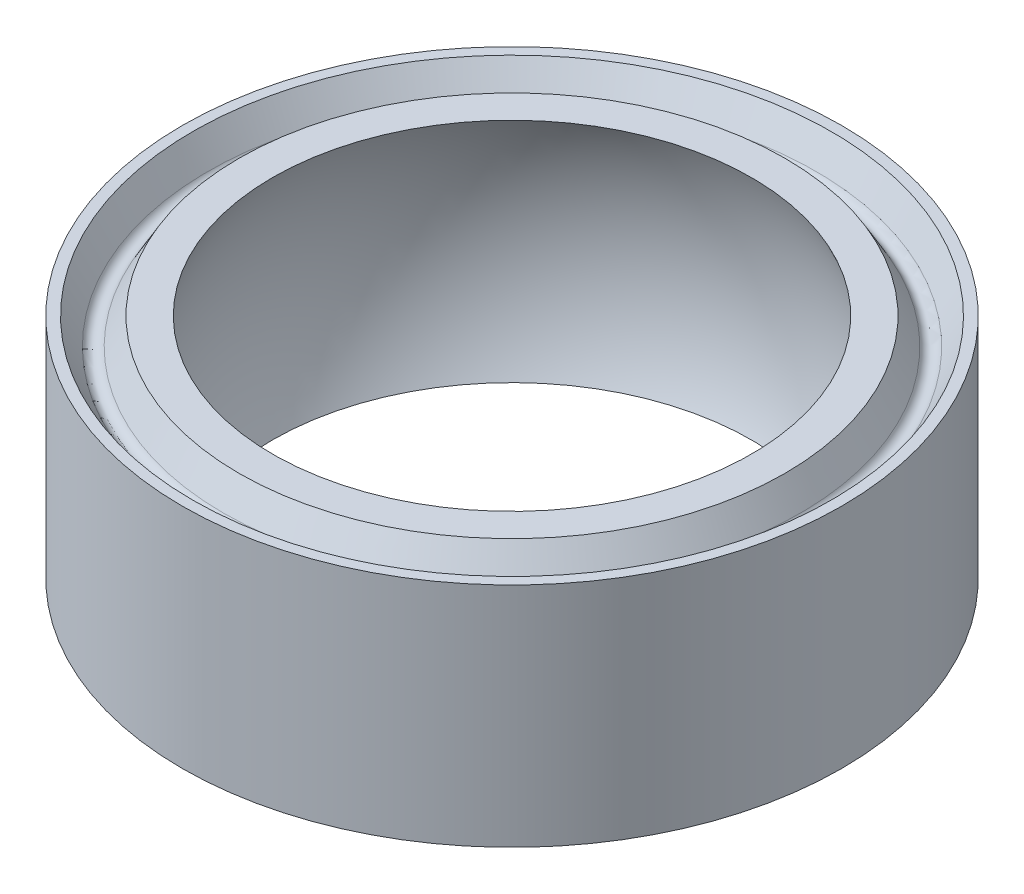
ISO-10303-21;
HEADER;
FILE_DESCRIPTION(('STEP AP214'),'2;1');
FILE_NAME('part.step','',(''),(''),'','','');
FILE_SCHEMA(('AUTOMOTIVE_DESIGN { 1 0 10303 214 1 1 1 1 }'));
ENDSEC;
DATA;
#1=APPLICATION_CONTEXT('core data for automotive mechanical design processes');
#2=APPLICATION_PROTOCOL_DEFINITION('international standard','automotive_design',2000,#1);
#3=PRODUCT_CONTEXT('',#1,'mechanical');
#4=PRODUCT('Part','Part','',(#3));
#5=PRODUCT_RELATED_PRODUCT_CATEGORY('part','',(#4));
#6=PRODUCT_DEFINITION_FORMATION('','',#4);
#7=PRODUCT_DEFINITION_CONTEXT('part definition',#1,'design');
#8=PRODUCT_DEFINITION('design','',#6,#7);
#9=PRODUCT_DEFINITION_SHAPE('','',#8);
#10=(LENGTH_UNIT() NAMED_UNIT(*) SI_UNIT(.MILLI.,.METRE.));
#11=(NAMED_UNIT(*) PLANE_ANGLE_UNIT() SI_UNIT($,.RADIAN.));
#12=(NAMED_UNIT(*) SI_UNIT($,.STERADIAN.) SOLID_ANGLE_UNIT());
#13=UNCERTAINTY_MEASURE_WITH_UNIT(LENGTH_MEASURE(1.E-05),#10,'distance_accuracy_value','');
#14=(GEOMETRIC_REPRESENTATION_CONTEXT(3) GLOBAL_UNCERTAINTY_ASSIGNED_CONTEXT((#13)) GLOBAL_UNIT_ASSIGNED_CONTEXT((#10,
#11,#12)) REPRESENTATION_CONTEXT('',''));
#15=CARTESIAN_POINT('',(0.,0.,0.));
#16=DIRECTION('',(0.,0.,1.));
#17=DIRECTION('',(1.,0.,0.));
#18=AXIS2_PLACEMENT_3D('',#15,#16,#17);
#19=CARTESIAN_POINT('',(-9.398,-3.2385,0.));
#20=DIRECTION('',(0.,-1.,0.));
#21=DIRECTION('',(0.,0.,-1.));
#22=AXIS2_PLACEMENT_3D('',#19,#20,#21);
#23=PLANE('',#22);
#24=CARTESIAN_POINT('',(0.,-3.2385,0.));
#25=DIRECTION('',(0.,1.,0.));
#26=DIRECTION('',(0.,0.,1.));
#27=AXIS2_PLACEMENT_3D('',#24,#25,#26);
#28=CIRCLE('',#27,7.780494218);
#29=CARTESIAN_POINT('',(0.,-3.2385,7.780494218));
#30=VERTEX_POINT('',#29);
#31=EDGE_CURVE('E64',#30,#30,#28,.T.);
#32=ORIENTED_EDGE('',*,*,#31,.F.);
#33=EDGE_LOOP('',(#32));
#34=FACE_BOUND('',#33,.T.);
#35=CARTESIAN_POINT('',(0.,-3.2385,0.));
#36=DIRECTION('',(0.,1.,0.));
#37=DIRECTION('',(0.,0.,1.));
#38=AXIS2_PLACEMENT_3D('',#35,#36,#37);
#39=CIRCLE('',#38,6.82735746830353);
#40=CARTESIAN_POINT('',(-6.82735746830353,-3.2385,0.));
#41=VERTEX_POINT('',#40);
#42=EDGE_CURVE('E10',#41,#41,#39,.T.);
#43=ORIENTED_EDGE('',*,*,#42,.T.);
#44=EDGE_LOOP('',(#43));
#45=FACE_BOUND('',#44,.T.);
#46=ADVANCED_FACE('F32',(#34,#45),#23,.T.);
#47=CARTESIAN_POINT('',(-9.398,3.2385,0.));
#48=DIRECTION('',(0.,1.,0.));
#49=DIRECTION('',(0.,0.,1.));
#50=AXIS2_PLACEMENT_3D('',#47,#48,#49);
#51=PLANE('',#50);
#52=CARTESIAN_POINT('',(0.,3.2385,0.));
#53=DIRECTION('',(0.,1.,0.));
#54=DIRECTION('',(0.,0.,1.));
#55=AXIS2_PLACEMENT_3D('',#52,#53,#54);
#56=CIRCLE('',#55,7.780494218);
#57=CARTESIAN_POINT('',(0.,3.2385,7.780494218));
#58=VERTEX_POINT('',#57);
#59=EDGE_CURVE('E52',#58,#58,#56,.T.);
#60=ORIENTED_EDGE('',*,*,#59,.T.);
#61=EDGE_LOOP('',(#60));
#62=FACE_BOUND('',#61,.T.);
#63=CARTESIAN_POINT('',(0.,3.2385,0.));
#64=DIRECTION('',(0.,1.,0.));
#65=DIRECTION('',(0.,0.,1.));
#66=AXIS2_PLACEMENT_3D('',#63,#64,#65);
#67=CIRCLE('',#66,6.82735746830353);
#68=CARTESIAN_POINT('',(-6.82735746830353,3.2385,0.));
#69=VERTEX_POINT('',#68);
#70=EDGE_CURVE('E39',#69,#69,#67,.T.);
#71=ORIENTED_EDGE('',*,*,#70,.F.);
#72=EDGE_LOOP('',(#71));
#73=FACE_BOUND('',#72,.T.);
#74=ADVANCED_FACE('F96',(#62,#73),#51,.T.);
#75=CARTESIAN_POINT('',(0.,-3.2385,0.));
#76=DIRECTION('',(0.,1.,0.));
#77=DIRECTION('',(0.,0.,1.));
#78=AXIS2_PLACEMENT_3D('',#75,#76,#77);
#79=CIRCLE('',#78,9.10031708);
#80=CARTESIAN_POINT('',(0.,-3.2385,9.10031708));
#81=VERTEX_POINT('',#80);
#82=EDGE_CURVE('E67',#81,#81,#79,.T.);
#83=ORIENTED_EDGE('',*,*,#82,.T.);
#84=EDGE_LOOP('',(#83));
#85=FACE_BOUND('',#84,.T.);
#86=CARTESIAN_POINT('',(0.,-3.2385,0.));
#87=DIRECTION('',(0.,1.,0.));
#88=DIRECTION('',(0.,0.,1.));
#89=AXIS2_PLACEMENT_3D('',#86,#87,#88);
#90=CIRCLE('',#89,9.398);
#91=CARTESIAN_POINT('',(0.,-3.2385,9.398));
#92=VERTEX_POINT('',#91);
#93=EDGE_CURVE('E47',#92,#92,#90,.T.);
#94=ORIENTED_EDGE('',*,*,#93,.F.);
#95=EDGE_LOOP('',(#94));
#96=FACE_BOUND('',#95,.T.);
#97=ADVANCED_FACE('F34',(#85,#96),#23,.T.);
#98=CARTESIAN_POINT('',(0.,0.,0.));
#99=DIRECTION('',(0.,1.,0.));
#100=DIRECTION('',(-1.,0.,0.));
#101=AXIS2_PLACEMENT_3D('',#98,#99,#100);
#102=SPHERICAL_SURFACE('',#101,7.5565);
#103=CARTESIAN_POINT('',(-6.82735746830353,3.2385,0.));
#104=CARTESIAN_POINT('',(-6.85724036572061,3.17550194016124,0.));
#105=CARTESIAN_POINT('',(-6.88625083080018,3.11209006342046,0.));
#106=CARTESIAN_POINT('',(-6.9425057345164,2.98448773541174,0.));
#107=CARTESIAN_POINT('',(-6.96975017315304,2.92029728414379,0.));
#108=CARTESIAN_POINT('',(-7.02245186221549,2.79118686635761,0.));
#109=CARTESIAN_POINT('',(-7.04790911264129,2.72626689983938,0.));
#110=CARTESIAN_POINT('',(-7.09701699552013,2.59574722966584,0.));
#111=CARTESIAN_POINT('',(-7.12066762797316,2.53014752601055,0.));
#112=CARTESIAN_POINT('',(-7.16614413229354,2.39831863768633,0.));
#113=CARTESIAN_POINT('',(-7.1879700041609,2.3320894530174,0.));
#114=CARTESIAN_POINT('',(-7.22978026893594,2.19905235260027,0.));
#115=CARTESIAN_POINT('',(-7.24976466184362,2.13224443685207,0.));
#116=CARTESIAN_POINT('',(-7.28787665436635,1.99810106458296,0.));
#117=CARTESIAN_POINT('',(-7.3060042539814,1.93076560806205,0.));
#118=CARTESIAN_POINT('',(-7.34038877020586,1.7956187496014,0.));
#119=CARTESIAN_POINT('',(-7.35664568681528,1.72780734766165,0.));
#120=CARTESIAN_POINT('',(-7.38727638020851,1.59176055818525,0.));
#121=CARTESIAN_POINT('',(-7.40165015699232,1.52352517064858,0.));
#122=CARTESIAN_POINT('',(-7.42850355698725,1.38668269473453,0.));
#123=CARTESIAN_POINT('',(-7.44098318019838,1.31807560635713,0.));
#124=CARTESIAN_POINT('',(-7.46403871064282,1.18054229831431,0.));
#125=CARTESIAN_POINT('',(-7.47461461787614,1.11161607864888,0.));
#126=CARTESIAN_POINT('',(-7.49385461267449,0.973497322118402,0.));
#127=CARTESIAN_POINT('',(-7.50251870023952,0.904304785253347,0.));
#128=CARTESIAN_POINT('',(-7.51792841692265,0.76570641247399,0.));
#129=CARTESIAN_POINT('',(-7.52467404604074,0.696300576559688,0.));
#130=CARTESIAN_POINT('',(-7.53624167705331,0.557328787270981,0.));
#131=CARTESIAN_POINT('',(-7.54106367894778,0.487762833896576,0.));
#132=CARTESIAN_POINT('',(-7.54878036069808,0.348524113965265,0.));
#133=CARTESIAN_POINT('',(-7.55167504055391,0.27885134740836,0.));
#134=CARTESIAN_POINT('',(-7.55553486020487,0.139452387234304,0.));
#135=CARTESIAN_POINT('',(-7.5565,0.0697261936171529,0.));
#136=CARTESIAN_POINT('',(-7.5565,-0.0697261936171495,0.));
#137=CARTESIAN_POINT('',(-7.55553486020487,-0.139452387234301,0.));
#138=CARTESIAN_POINT('',(-7.55167504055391,-0.278851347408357,0.));
#139=CARTESIAN_POINT('',(-7.54878036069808,-0.348524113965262,0.));
#140=CARTESIAN_POINT('',(-7.54106367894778,-0.487762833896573,0.));
#141=CARTESIAN_POINT('',(-7.53624167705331,-0.557328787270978,0.));
#142=CARTESIAN_POINT('',(-7.52467404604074,-0.696300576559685,0.));
#143=CARTESIAN_POINT('',(-7.51792841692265,-0.765706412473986,0.));
#144=CARTESIAN_POINT('',(-7.50251870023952,-0.904304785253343,0.));
#145=CARTESIAN_POINT('',(-7.49385461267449,-0.973497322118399,0.));
#146=CARTESIAN_POINT('',(-7.47461461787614,-1.11161607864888,0.));
#147=CARTESIAN_POINT('',(-7.46403871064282,-1.1805422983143,0.));
#148=CARTESIAN_POINT('',(-7.44098318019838,-1.31807560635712,0.));
#149=CARTESIAN_POINT('',(-7.42850355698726,-1.38668269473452,0.));
#150=CARTESIAN_POINT('',(-7.40165015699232,-1.52352517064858,0.));
#151=CARTESIAN_POINT('',(-7.38727638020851,-1.59176055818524,0.));
#152=CARTESIAN_POINT('',(-7.35664568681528,-1.72780734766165,0.));
#153=CARTESIAN_POINT('',(-7.34038877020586,-1.79561874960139,0.));
#154=CARTESIAN_POINT('',(-7.3060042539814,-1.93076560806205,0.));
#155=CARTESIAN_POINT('',(-7.28787665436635,-1.99810106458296,0.));
#156=CARTESIAN_POINT('',(-7.24976466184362,-2.13224443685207,0.));
#157=CARTESIAN_POINT('',(-7.22978026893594,-2.19905235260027,0.));
#158=CARTESIAN_POINT('',(-7.1879700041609,-2.3320894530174,0.));
#159=CARTESIAN_POINT('',(-7.16614413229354,-2.39831863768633,0.));
#160=CARTESIAN_POINT('',(-7.12066762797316,-2.53014752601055,0.));
#161=CARTESIAN_POINT('',(-7.09701699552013,-2.59574722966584,0.));
#162=CARTESIAN_POINT('',(-7.0479091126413,-2.72626689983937,0.));
#163=CARTESIAN_POINT('',(-7.02245186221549,-2.79118686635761,0.));
#164=CARTESIAN_POINT('',(-6.96975017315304,-2.92029728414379,0.));
#165=CARTESIAN_POINT('',(-6.9425057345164,-2.98448773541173,0.));
#166=CARTESIAN_POINT('',(-6.88625083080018,-3.11209006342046,0.));
#167=CARTESIAN_POINT('',(-6.85724036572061,-3.17550194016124,0.));
#168=CARTESIAN_POINT('',(-6.82735746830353,-3.2385,0.));
#169=B_SPLINE_CURVE_WITH_KNOTS('',3,(#103,#104,#105,#106,#107,#108,#109,#110,#111,#112,#113,
#114,#115,#116,#117,#118,#119,#120,#121,#122,#123,#124,#125,#126,#127,#128,#129,#130,#131,#132,
#133,#134,#135,#136,#137,#138,#139,#140,#141,#142,#143,#144,#145,#146,#147,#148,#149,#150,#151,
#152,#153,#154,#155,#156,#157,#158,#159,#160,#161,#162,#163,#164,#165,#166,#167,#168),
.UNSPECIFIED.,.F.,.F.,(4,2,2,2,2,2,2,2,2,2,2,2,2,2,2,2,2,2,2,2,2,2,2,2,2,2,2,2,2,2,2,2,4),(0.,
0.209171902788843,0.418343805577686,0.627515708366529,0.836687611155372,1.04585951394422,
1.25503141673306,1.4642033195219,1.67337522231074,1.88254712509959,2.09171902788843,
2.30089093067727,2.51006283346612,2.71923473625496,2.9284066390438,3.13757854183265,
3.34675044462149,3.55592234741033,3.76509425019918,3.97426615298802,4.18343805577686,
4.3926099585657,4.60178186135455,4.81095376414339,5.02012566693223,5.22929756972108,
5.43846947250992,5.64764137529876,5.85681327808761,6.06598518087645,6.27515708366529,
6.48432898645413,6.69350088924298),.UNSPECIFIED.);
#170=EDGE_CURVE('BSEAM106',#69,#41,#169,.T.);
#171=ORIENTED_EDGE('',*,*,#70,.T.);
#172=ORIENTED_EDGE('',*,*,#42,.F.);
#173=ORIENTED_EDGE('',*,*,#170,.T.);
#174=ORIENTED_EDGE('',*,*,#170,.F.);
#175=EDGE_LOOP('',(#171,#173,#172,#174));
#176=FACE_BOUND('',#175,.T.);
#177=ADVANCED_FACE('F106',(#176),#102,.F.);
#178=CARTESIAN_POINT('',(0.,3.2385,0.));
#179=DIRECTION('',(0.,1.,0.));
#180=DIRECTION('',(0.,0.,1.));
#181=AXIS2_PLACEMENT_3D('',#178,#179,#180);
#182=CIRCLE('',#181,9.10031708);
#183=CARTESIAN_POINT('',(0.,3.2385,9.10031708));
#184=VERTEX_POINT('',#183);
#185=EDGE_CURVE('E55',#184,#184,#182,.T.);
#186=ORIENTED_EDGE('',*,*,#185,.F.);
#187=EDGE_LOOP('',(#186));
#188=FACE_BOUND('',#187,.T.);
#189=CARTESIAN_POINT('',(0.,3.2385,0.));
#190=DIRECTION('',(0.,1.,0.));
#191=DIRECTION('',(0.,0.,1.));
#192=AXIS2_PLACEMENT_3D('',#189,#190,#191);
#193=CIRCLE('',#192,9.398);
#194=CARTESIAN_POINT('',(0.,3.2385,9.398));
#195=VERTEX_POINT('',#194);
#196=EDGE_CURVE('E43',#195,#195,#193,.T.);
#197=ORIENTED_EDGE('',*,*,#196,.T.);
#198=EDGE_LOOP('',(#197));
#199=FACE_BOUND('',#198,.T.);
#200=ADVANCED_FACE('F103',(#188,#199),#51,.T.);
#201=CARTESIAN_POINT('',(0.,32.8905871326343,0.));
#202=DIRECTION('',(0.,1.,0.));
#203=DIRECTION('',(0.,0.,1.));
#204=AXIS2_PLACEMENT_3D('',#201,#202,#203);
#205=CYLINDRICAL_SURFACE('',#204,9.398);
#206=ORIENTED_EDGE('',*,*,#93,.T.);
#207=EDGE_LOOP('',(#206));
#208=FACE_BOUND('',#207,.T.);
#209=ORIENTED_EDGE('',*,*,#196,.F.);
#210=EDGE_LOOP('',(#209));
#211=FACE_BOUND('',#210,.T.);
#212=ADVANCED_FACE('F115',(#208,#211),#205,.T.);
#213=CARTESIAN_POINT('',(0.,2.47649987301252,0.));
#214=DIRECTION('',(0.,-1.,0.));
#215=DIRECTION('',(0.,0.,-1.));
#216=AXIS2_PLACEMENT_3D('',#213,#214,#215);
#217=CONICAL_SURFACE('',#216,8.22043519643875,0.5235987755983);
#218=ORIENTED_EDGE('',*,*,#59,.F.);
#219=EDGE_LOOP('',(#218));
#220=FACE_BOUND('',#219,.T.);
#221=CARTESIAN_POINT('',(0.,2.47649987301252,0.));
#222=DIRECTION('',(0.,1.,0.));
#223=DIRECTION('',(0.,0.,1.));
#224=AXIS2_PLACEMENT_3D('',#221,#222,#223);
#225=CIRCLE('',#224,8.22043519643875);
#226=CARTESIAN_POINT('',(0.,2.47649987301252,8.22043519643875));
#227=VERTEX_POINT('',#226);
#228=EDGE_CURVE('E61',#227,#227,#225,.T.);
#229=ORIENTED_EDGE('',*,*,#228,.T.);
#230=EDGE_LOOP('',(#229));
#231=FACE_BOUND('',#230,.T.);
#232=ADVANCED_FACE('F118',(#220,#231),#217,.T.);
#233=CARTESIAN_POINT('',(0.,3.2385,0.));
#234=DIRECTION('',(0.,1.,0.));
#235=DIRECTION('',(0.,0.,1.));
#236=AXIS2_PLACEMENT_3D('',#233,#234,#235);
#237=CONICAL_SURFACE('',#236,9.10031708,0.523598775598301);
#238=CARTESIAN_POINT('',(0.,2.47649987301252,0.));
#239=DIRECTION('',(0.,1.,0.));
#240=DIRECTION('',(0.,0.,1.));
#241=AXIS2_PLACEMENT_3D('',#238,#239,#240);
#242=CIRCLE('',#241,8.66037610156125);
#243=CARTESIAN_POINT('',(0.,2.47649987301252,8.66037610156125));
#244=VERTEX_POINT('',#243);
#245=EDGE_CURVE('E58',#244,#244,#242,.T.);
#246=ORIENTED_EDGE('',*,*,#245,.F.);
#247=EDGE_LOOP('',(#246));
#248=FACE_BOUND('',#247,.T.);
#249=ORIENTED_EDGE('',*,*,#185,.T.);
#250=EDGE_LOOP('',(#249));
#251=FACE_BOUND('',#250,.T.);
#252=ADVANCED_FACE('F92',(#248,#251),#237,.F.);
#253=CARTESIAN_POINT('',(0.,2.60349987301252,0.));
#254=DIRECTION('',(0.,1.,0.));
#255=DIRECTION('',(0.,0.,1.));
#256=AXIS2_PLACEMENT_3D('',#253,#254,#255);
#257=TOROIDAL_SURFACE('',#256,8.440405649,0.254);
#258=ORIENTED_EDGE('',*,*,#228,.F.);
#259=EDGE_LOOP('',(#258));
#260=FACE_BOUND('',#259,.T.);
#261=ORIENTED_EDGE('',*,*,#245,.T.);
#262=EDGE_LOOP('',(#261));
#263=FACE_BOUND('',#262,.T.);
#264=ADVANCED_FACE('F83',(#260,#263),#257,.F.);
#265=CARTESIAN_POINT('',(0.,-2.47649987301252,0.));
#266=DIRECTION('',(0.,1.,0.));
#267=DIRECTION('',(0.,0.,-1.));
#268=AXIS2_PLACEMENT_3D('',#265,#266,#267);
#269=CONICAL_SURFACE('',#268,8.22043519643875,0.5235987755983);
#270=ORIENTED_EDGE('',*,*,#31,.T.);
#271=EDGE_LOOP('',(#270));
#272=FACE_BOUND('',#271,.T.);
#273=CARTESIAN_POINT('',(0.,-2.47649987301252,0.));
#274=DIRECTION('',(0.,1.,0.));
#275=DIRECTION('',(0.,0.,1.));
#276=AXIS2_PLACEMENT_3D('',#273,#274,#275);
#277=CIRCLE('',#276,8.22043519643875);
#278=CARTESIAN_POINT('',(0.,-2.47649987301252,8.22043519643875));
#279=VERTEX_POINT('',#278);
#280=EDGE_CURVE('E73',#279,#279,#277,.T.);
#281=ORIENTED_EDGE('',*,*,#280,.F.);
#282=EDGE_LOOP('',(#281));
#283=FACE_BOUND('',#282,.T.);
#284=ADVANCED_FACE('F80',(#272,#283),#269,.T.);
#285=CARTESIAN_POINT('',(0.,-3.2385,0.));
#286=DIRECTION('',(0.,-1.,0.));
#287=DIRECTION('',(0.,0.,1.));
#288=AXIS2_PLACEMENT_3D('',#285,#286,#287);
#289=CONICAL_SURFACE('',#288,9.10031708,0.523598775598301);
#290=CARTESIAN_POINT('',(0.,-2.47649987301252,0.));
#291=DIRECTION('',(0.,1.,0.));
#292=DIRECTION('',(0.,0.,1.));
#293=AXIS2_PLACEMENT_3D('',#290,#291,#292);
#294=CIRCLE('',#293,8.66037610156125);
#295=CARTESIAN_POINT('',(0.,-2.47649987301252,8.66037610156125));
#296=VERTEX_POINT('',#295);
#297=EDGE_CURVE('E70',#296,#296,#294,.T.);
#298=ORIENTED_EDGE('',*,*,#297,.T.);
#299=EDGE_LOOP('',(#298));
#300=FACE_BOUND('',#299,.T.);
#301=ORIENTED_EDGE('',*,*,#82,.F.);
#302=EDGE_LOOP('',(#301));
#303=FACE_BOUND('',#302,.T.);
#304=ADVANCED_FACE('F82',(#300,#303),#289,.F.);
#305=CARTESIAN_POINT('',(0.,-2.60349987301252,0.));
#306=DIRECTION('',(0.,-1.,0.));
#307=DIRECTION('',(0.,0.,1.));
#308=AXIS2_PLACEMENT_3D('',#305,#306,#307);
#309=TOROIDAL_SURFACE('',#308,8.440405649,0.254);
#310=ORIENTED_EDGE('',*,*,#280,.T.);
#311=EDGE_LOOP('',(#310));
#312=FACE_BOUND('',#311,.T.);
#313=ORIENTED_EDGE('',*,*,#297,.F.);
#314=EDGE_LOOP('',(#313));
#315=FACE_BOUND('',#314,.T.);
#316=ADVANCED_FACE('F77',(#312,#315),#309,.F.);
#317=CLOSED_SHELL('',(#46,#74,#97,#177,#200,#212,#232,#252,#264,#284,#304,#316));
#318=MANIFOLD_SOLID_BREP('B2',#317);
#319=ADVANCED_BREP_SHAPE_REPRESENTATION('',(#18,#318),#14);
#320=SHAPE_DEFINITION_REPRESENTATION(#9,#319);
ENDSEC;
END-ISO-10303-21;
